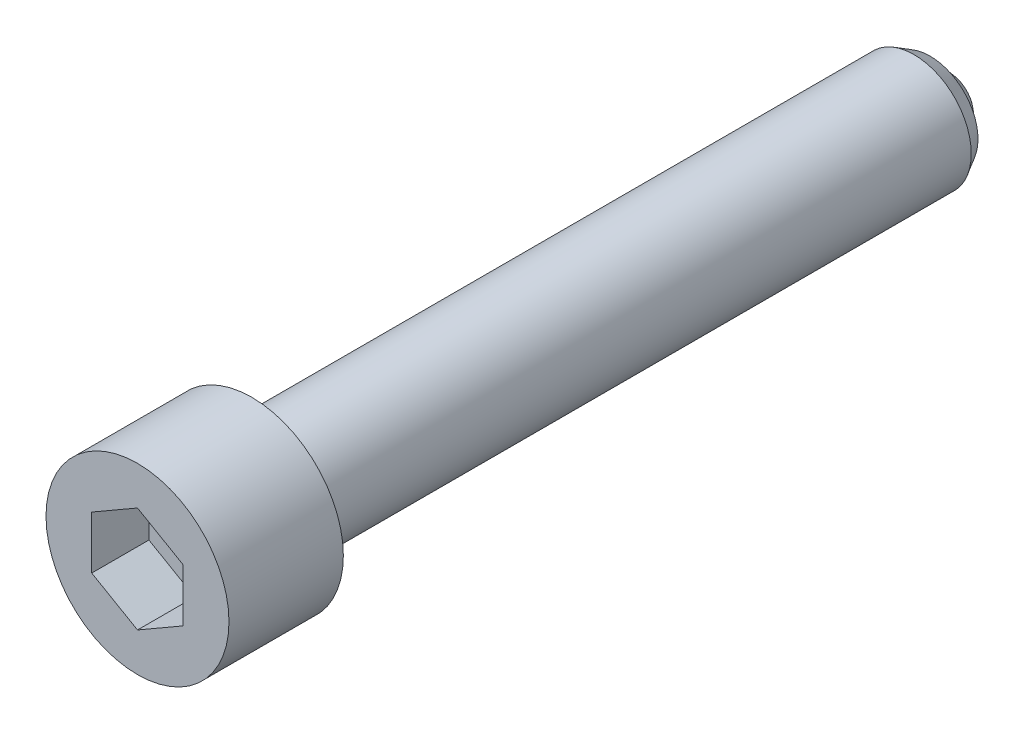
ISO-10303-21;
HEADER;
FILE_DESCRIPTION(('STEP AP214'),'2;1');
FILE_NAME('part.step','',(''),(''),'','','');
FILE_SCHEMA(('AUTOMOTIVE_DESIGN { 1 0 10303 214 1 1 1 1 }'));
ENDSEC;
DATA;
#1=APPLICATION_CONTEXT('core data for automotive mechanical design processes');
#2=APPLICATION_PROTOCOL_DEFINITION('international standard','automotive_design',2000,#1);
#3=PRODUCT_CONTEXT('',#1,'mechanical');
#4=PRODUCT('Part','Part','',(#3));
#5=PRODUCT_RELATED_PRODUCT_CATEGORY('part','',(#4));
#6=PRODUCT_DEFINITION_FORMATION('','',#4);
#7=PRODUCT_DEFINITION_CONTEXT('part definition',#1,'design');
#8=PRODUCT_DEFINITION('design','',#6,#7);
#9=PRODUCT_DEFINITION_SHAPE('','',#8);
#10=(LENGTH_UNIT() NAMED_UNIT(*) SI_UNIT(.MILLI.,.METRE.));
#11=(NAMED_UNIT(*) PLANE_ANGLE_UNIT() SI_UNIT($,.RADIAN.));
#12=(NAMED_UNIT(*) SI_UNIT($,.STERADIAN.) SOLID_ANGLE_UNIT());
#13=UNCERTAINTY_MEASURE_WITH_UNIT(LENGTH_MEASURE(1.E-05),#10,'distance_accuracy_value','');
#14=(GEOMETRIC_REPRESENTATION_CONTEXT(3) GLOBAL_UNCERTAINTY_ASSIGNED_CONTEXT((#13)) GLOBAL_UNIT_ASSIGNED_CONTEXT((#10,
#11,#12)) REPRESENTATION_CONTEXT('',''));
#15=CARTESIAN_POINT('',(0.,0.,0.));
#16=DIRECTION('',(0.,0.,1.));
#17=DIRECTION('',(1.,0.,0.));
#18=AXIS2_PLACEMENT_3D('',#15,#16,#17);
#19=CARTESIAN_POINT('',(0.,0.,3.5));
#20=DIRECTION('',(0.,0.,-1.));
#21=DIRECTION('',(1.,0.,0.));
#22=AXIS2_PLACEMENT_3D('',#19,#20,#21);
#23=SPHERICAL_SURFACE('',#22,3.5);
#24=CARTESIAN_POINT('',(0.,0.,2.4));
#25=DIRECTION('',(0.,0.,-1.));
#26=DIRECTION('',(1.,0.,0.));
#27=AXIS2_PLACEMENT_3D('',#24,#25,#26);
#28=CIRCLE('',#27,3.32264954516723);
#29=CARTESIAN_POINT('',(3.32264954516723,0.,2.4));
#30=VERTEX_POINT('',#29);
#31=EDGE_CURVE('E9',#30,#30,#28,.T.);
#32=ORIENTED_EDGE('',*,*,#31,.T.);
#33=EDGE_LOOP('',(#32));
#34=FACE_BOUND('',#33,.T.);
#35=ADVANCED_FACE('F15',(#34),#23,.T.);
#36=CARTESIAN_POINT('',(4.19170962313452,0.,2.4));
#37=DIRECTION('',(0.,0.,1.));
#38=DIRECTION('',(-1.,0.,0.));
#39=AXIS2_PLACEMENT_3D('',#36,#37,#38);
#40=PLANE('',#39);
#41=ORIENTED_EDGE('',*,*,#31,.F.);
#42=EDGE_LOOP('',(#41));
#43=FACE_BOUND('',#42,.T.);
#44=CARTESIAN_POINT('',(0.,0.,2.4));
#45=DIRECTION('',(0.,0.,-1.));
#46=DIRECTION('',(1.,0.,0.));
#47=AXIS2_PLACEMENT_3D('',#44,#45,#46);
#48=CIRCLE('',#47,4.19170962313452);
#49=CARTESIAN_POINT('',(4.19170962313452,0.,2.4));
#50=VERTEX_POINT('',#49);
#51=EDGE_CURVE('E22',#50,#50,#48,.T.);
#52=ORIENTED_EDGE('',*,*,#51,.T.);
#53=EDGE_LOOP('',(#52));
#54=FACE_BOUND('',#53,.T.);
#55=ADVANCED_FACE('F136',(#43,#54),#40,.F.);
#56=CARTESIAN_POINT('',(0.,0.,3.8));
#57=DIRECTION('',(0.,0.,1.));
#58=DIRECTION('',(-1.,0.,0.));
#59=AXIS2_PLACEMENT_3D('',#56,#57,#58);
#60=CONICAL_SURFACE('',#59,5.,0.5235987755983);
#61=ORIENTED_EDGE('',*,*,#51,.F.);
#62=EDGE_LOOP('',(#61));
#63=FACE_BOUND('',#62,.T.);
#64=CARTESIAN_POINT('',(0.,0.,3.8));
#65=DIRECTION('',(0.,0.,-1.));
#66=DIRECTION('',(1.,0.,0.));
#67=AXIS2_PLACEMENT_3D('',#64,#65,#66);
#68=CIRCLE('',#67,5.);
#69=CARTESIAN_POINT('',(5.,0.,3.8));
#70=VERTEX_POINT('',#69);
#71=EDGE_CURVE('E131',#70,#70,#68,.T.);
#72=ORIENTED_EDGE('',*,*,#71,.T.);
#73=EDGE_LOOP('',(#72));
#74=FACE_BOUND('',#73,.T.);
#75=ADVANCED_FACE('F138',(#63,#74),#60,.T.);
#76=CARTESIAN_POINT('',(0.,0.,11.7));
#77=DIRECTION('',(0.,0.,-1.));
#78=DIRECTION('',(1.,0.,0.));
#79=AXIS2_PLACEMENT_3D('',#76,#77,#78);
#80=CYLINDRICAL_SURFACE('',#79,5.);
#81=CARTESIAN_POINT('',(0.,0.,61.7));
#82=DIRECTION('',(0.,0.,-1.));
#83=DIRECTION('',(1.,0.,0.));
#84=AXIS2_PLACEMENT_3D('',#81,#82,#83);
#85=CIRCLE('',#84,5.);
#86=CARTESIAN_POINT('',(5.,0.,61.7));
#87=VERTEX_POINT('',#86);
#88=EDGE_CURVE('E128',#87,#87,#85,.T.);
#89=ORIENTED_EDGE('',*,*,#88,.T.);
#90=EDGE_LOOP('',(#89));
#91=FACE_BOUND('',#90,.T.);
#92=ORIENTED_EDGE('',*,*,#71,.F.);
#93=EDGE_LOOP('',(#92));
#94=FACE_BOUND('',#93,.T.);
#95=ADVANCED_FACE('F141',(#91,#94),#80,.T.);
#96=CARTESIAN_POINT('',(5.,0.,61.7));
#97=DIRECTION('',(0.,0.,-1.));
#98=DIRECTION('',(1.,0.,0.));
#99=AXIS2_PLACEMENT_3D('',#96,#97,#98);
#100=PLANE('',#99);
#101=CARTESIAN_POINT('',(0.,0.,61.7));
#102=DIRECTION('',(0.,0.,-1.));
#103=DIRECTION('',(1.,0.,0.));
#104=AXIS2_PLACEMENT_3D('',#101,#102,#103);
#105=CIRCLE('',#104,8.);
#106=CARTESIAN_POINT('',(8.,0.,61.7));
#107=VERTEX_POINT('',#106);
#108=EDGE_CURVE('E125',#107,#107,#105,.T.);
#109=ORIENTED_EDGE('',*,*,#108,.T.);
#110=EDGE_LOOP('',(#109));
#111=FACE_BOUND('',#110,.T.);
#112=ORIENTED_EDGE('',*,*,#88,.F.);
#113=EDGE_LOOP('',(#112));
#114=FACE_BOUND('',#113,.T.);
#115=ADVANCED_FACE('F146',(#111,#114),#100,.T.);
#116=CARTESIAN_POINT('',(0.,0.,11.7));
#117=DIRECTION('',(0.,0.,-1.));
#118=DIRECTION('',(1.,0.,0.));
#119=AXIS2_PLACEMENT_3D('',#116,#117,#118);
#120=CYLINDRICAL_SURFACE('',#119,8.);
#121=CARTESIAN_POINT('',(0.,0.,71.7));
#122=DIRECTION('',(0.,0.,-1.));
#123=DIRECTION('',(1.,0.,0.));
#124=AXIS2_PLACEMENT_3D('',#121,#122,#123);
#125=CIRCLE('',#124,8.);
#126=CARTESIAN_POINT('',(8.,0.,71.7));
#127=VERTEX_POINT('',#126);
#128=EDGE_CURVE('E122',#127,#127,#125,.T.);
#129=ORIENTED_EDGE('',*,*,#128,.T.);
#130=EDGE_LOOP('',(#129));
#131=FACE_BOUND('',#130,.T.);
#132=ORIENTED_EDGE('',*,*,#108,.F.);
#133=EDGE_LOOP('',(#132));
#134=FACE_BOUND('',#133,.T.);
#135=ADVANCED_FACE('F153',(#131,#134),#120,.T.);
#136=CARTESIAN_POINT('',(8.,0.,71.7));
#137=DIRECTION('',(0.,0.,1.));
#138=DIRECTION('',(-1.,0.,0.));
#139=AXIS2_PLACEMENT_3D('',#136,#137,#138);
#140=PLANE('',#139);
#141=DIRECTION('',(-0.86602540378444,0.5,0.));
#142=VECTOR('',#141,1.);
#143=CARTESIAN_POINT('',(4.,2.30940107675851,71.7));
#144=LINE('',#143,#142);
#145=CARTESIAN_POINT('',(4.,2.30940107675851,71.7));
#146=VERTEX_POINT('',#145);
#147=CARTESIAN_POINT('',(0.,4.618802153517,71.7));
#148=VERTEX_POINT('',#147);
#149=EDGE_CURVE('E29',#146,#148,#144,.T.);
#150=ORIENTED_EDGE('',*,*,#149,.F.);
#151=DIRECTION('',(0.,1.,0.));
#152=VECTOR('',#151,1.);
#153=CARTESIAN_POINT('',(4.,-2.30940107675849,71.7));
#154=LINE('',#153,#152);
#155=CARTESIAN_POINT('',(4.,-2.30940107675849,71.7));
#156=VERTEX_POINT('',#155);
#157=EDGE_CURVE('E98',#156,#146,#154,.T.);
#158=ORIENTED_EDGE('',*,*,#157,.F.);
#159=DIRECTION('',(-0.866025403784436,-0.5,0.));
#160=VECTOR('',#159,1.);
#161=CARTESIAN_POINT('',(4.,-2.30940107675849,71.7));
#162=LINE('',#161,#160);
#163=CARTESIAN_POINT('',(0.,-4.61880215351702,71.7));
#164=VERTEX_POINT('',#163);
#165=EDGE_CURVE('E93',#156,#164,#162,.T.);
#166=ORIENTED_EDGE('',*,*,#165,.T.);
#167=DIRECTION('',(0.866025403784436,-0.5,0.));
#168=VECTOR('',#167,1.);
#169=CARTESIAN_POINT('',(-4.,-2.30940107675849,71.7));
#170=LINE('',#169,#168);
#171=CARTESIAN_POINT('',(-4.,-2.30940107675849,71.7));
#172=VERTEX_POINT('',#171);
#173=EDGE_CURVE('E91',#172,#164,#170,.T.);
#174=ORIENTED_EDGE('',*,*,#173,.F.);
#175=DIRECTION('',(0.,1.,0.));
#176=VECTOR('',#175,1.);
#177=CARTESIAN_POINT('',(-4.,-2.30940107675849,71.7));
#178=LINE('',#177,#176);
#179=CARTESIAN_POINT('',(-4.,2.30940107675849,71.7));
#180=VERTEX_POINT('',#179);
#181=EDGE_CURVE('E72',#172,#180,#178,.T.);
#182=ORIENTED_EDGE('',*,*,#181,.T.);
#183=DIRECTION('',(0.866025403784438,0.5,0.));
#184=VECTOR('',#183,1.);
#185=CARTESIAN_POINT('',(-4.,2.30940107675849,71.7));
#186=LINE('',#185,#184);
#187=EDGE_CURVE('E83',#180,#148,#186,.T.);
#188=ORIENTED_EDGE('',*,*,#187,.T.);
#189=EDGE_LOOP('',(#150,#158,#166,#174,#182,#188));
#190=FACE_BOUND('',#189,.T.);
#191=ORIENTED_EDGE('',*,*,#128,.F.);
#192=EDGE_LOOP('',(#191));
#193=FACE_BOUND('',#192,.T.);
#194=ADVANCED_FACE('F87',(#190,#193),#140,.T.);
#195=CARTESIAN_POINT('',(4.,2.30940107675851,66.7));
#196=DIRECTION('',(0.5,0.86602540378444,0.));
#197=DIRECTION('',(0.86602540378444,-0.5,0.));
#198=AXIS2_PLACEMENT_3D('',#195,#196,#197);
#199=PLANE('',#198);
#200=DIRECTION('',(0.,0.,1.));
#201=VECTOR('',#200,1.);
#202=CARTESIAN_POINT('',(4.,2.30940107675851,66.7));
#203=LINE('',#202,#201);
#204=CARTESIAN_POINT('',(4.,2.30940107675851,66.7));
#205=VERTEX_POINT('',#204);
#206=EDGE_CURVE('E36',#205,#146,#203,.T.);
#207=ORIENTED_EDGE('',*,*,#206,.T.);
#208=ORIENTED_EDGE('',*,*,#149,.T.);
#209=DIRECTION('',(0.,0.,1.));
#210=VECTOR('',#209,1.);
#211=CARTESIAN_POINT('',(0.,4.618802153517,66.7));
#212=LINE('',#211,#210);
#213=CARTESIAN_POINT('',(0.,4.618802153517,66.7));
#214=VERTEX_POINT('',#213);
#215=EDGE_CURVE('E80',#214,#148,#212,.T.);
#216=ORIENTED_EDGE('',*,*,#215,.F.);
#217=DIRECTION('',(-0.86602540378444,0.5,0.));
#218=VECTOR('',#217,1.);
#219=CARTESIAN_POINT('',(4.,2.30940107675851,66.7));
#220=LINE('',#219,#218);
#221=EDGE_CURVE('E100',#205,#214,#220,.T.);
#222=ORIENTED_EDGE('',*,*,#221,.F.);
#223=EDGE_LOOP('',(#207,#208,#216,#222));
#224=FACE_BOUND('',#223,.T.);
#225=ADVANCED_FACE('F205',(#224),#199,.F.);
#226=CARTESIAN_POINT('',(4.,-2.30940107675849,66.7));
#227=DIRECTION('',(1.,0.,0.));
#228=DIRECTION('',(0.,-1.,0.));
#229=AXIS2_PLACEMENT_3D('',#226,#227,#228);
#230=PLANE('',#229);
#231=DIRECTION('',(0.,0.,1.));
#232=VECTOR('',#231,1.);
#233=CARTESIAN_POINT('',(4.,-2.30940107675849,66.7));
#234=LINE('',#233,#232);
#235=CARTESIAN_POINT('',(4.,-2.30940107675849,66.7));
#236=VERTEX_POINT('',#235);
#237=EDGE_CURVE('E119',#236,#156,#234,.T.);
#238=ORIENTED_EDGE('',*,*,#237,.T.);
#239=ORIENTED_EDGE('',*,*,#157,.T.);
#240=ORIENTED_EDGE('',*,*,#206,.F.);
#241=DIRECTION('',(0.,1.,0.));
#242=VECTOR('',#241,1.);
#243=CARTESIAN_POINT('',(4.,-2.30940107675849,66.7));
#244=LINE('',#243,#242);
#245=EDGE_CURVE('E112',#236,#205,#244,.T.);
#246=ORIENTED_EDGE('',*,*,#245,.F.);
#247=EDGE_LOOP('',(#238,#239,#240,#246));
#248=FACE_BOUND('',#247,.T.);
#249=ADVANCED_FACE('F214',(#248),#230,.F.);
#250=CARTESIAN_POINT('',(4.,-2.30940107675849,66.7));
#251=DIRECTION('',(-0.5,0.866025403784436,0.));
#252=DIRECTION('',(0.866025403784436,0.5,0.));
#253=AXIS2_PLACEMENT_3D('',#250,#251,#252);
#254=PLANE('',#253);
#255=DIRECTION('',(0.,0.,1.));
#256=VECTOR('',#255,1.);
#257=CARTESIAN_POINT('',(0.,-4.61880215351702,66.7));
#258=LINE('',#257,#256);
#259=CARTESIAN_POINT('',(0.,-4.61880215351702,66.7));
#260=VERTEX_POINT('',#259);
#261=EDGE_CURVE('E117',#260,#164,#258,.T.);
#262=ORIENTED_EDGE('',*,*,#261,.T.);
#263=ORIENTED_EDGE('',*,*,#165,.F.);
#264=ORIENTED_EDGE('',*,*,#237,.F.);
#265=DIRECTION('',(-0.866025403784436,-0.5,0.));
#266=VECTOR('',#265,1.);
#267=CARTESIAN_POINT('',(4.,-2.30940107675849,66.7));
#268=LINE('',#267,#266);
#269=EDGE_CURVE('E109',#236,#260,#268,.T.);
#270=ORIENTED_EDGE('',*,*,#269,.T.);
#271=EDGE_LOOP('',(#262,#263,#264,#270));
#272=FACE_BOUND('',#271,.T.);
#273=ADVANCED_FACE('F223',(#272),#254,.T.);
#274=CARTESIAN_POINT('',(-4.,-2.30940107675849,66.7));
#275=DIRECTION('',(-0.5,-0.866025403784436,0.));
#276=DIRECTION('',(-0.866025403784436,0.5,0.));
#277=AXIS2_PLACEMENT_3D('',#274,#275,#276);
#278=PLANE('',#277);
#279=DIRECTION('',(0.,0.,1.));
#280=VECTOR('',#279,1.);
#281=CARTESIAN_POINT('',(-4.,-2.30940107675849,66.7));
#282=LINE('',#281,#280);
#283=CARTESIAN_POINT('',(-4.,-2.30940107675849,66.7));
#284=VERTEX_POINT('',#283);
#285=EDGE_CURVE('E79',#284,#172,#282,.T.);
#286=ORIENTED_EDGE('',*,*,#285,.T.);
#287=ORIENTED_EDGE('',*,*,#173,.T.);
#288=ORIENTED_EDGE('',*,*,#261,.F.);
#289=DIRECTION('',(0.866025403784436,-0.5,0.));
#290=VECTOR('',#289,1.);
#291=CARTESIAN_POINT('',(-4.,-2.30940107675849,66.7));
#292=LINE('',#291,#290);
#293=EDGE_CURVE('E106',#284,#260,#292,.T.);
#294=ORIENTED_EDGE('',*,*,#293,.F.);
#295=EDGE_LOOP('',(#286,#287,#288,#294));
#296=FACE_BOUND('',#295,.T.);
#297=ADVANCED_FACE('F232',(#296),#278,.F.);
#298=CARTESIAN_POINT('',(-4.,-2.30940107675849,66.7));
#299=DIRECTION('',(1.,0.,0.));
#300=DIRECTION('',(0.,-1.,0.));
#301=AXIS2_PLACEMENT_3D('',#298,#299,#300);
#302=PLANE('',#301);
#303=DIRECTION('',(0.,0.,1.));
#304=VECTOR('',#303,1.);
#305=CARTESIAN_POINT('',(-4.,2.30940107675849,66.7));
#306=LINE('',#305,#304);
#307=CARTESIAN_POINT('',(-4.,2.30940107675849,66.7));
#308=VERTEX_POINT('',#307);
#309=EDGE_CURVE('E68',#308,#180,#306,.T.);
#310=ORIENTED_EDGE('',*,*,#309,.T.);
#311=ORIENTED_EDGE('',*,*,#181,.F.);
#312=ORIENTED_EDGE('',*,*,#285,.F.);
#313=DIRECTION('',(0.,1.,0.));
#314=VECTOR('',#313,1.);
#315=CARTESIAN_POINT('',(-4.,-2.30940107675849,66.7));
#316=LINE('',#315,#314);
#317=EDGE_CURVE('E75',#284,#308,#316,.T.);
#318=ORIENTED_EDGE('',*,*,#317,.T.);
#319=EDGE_LOOP('',(#310,#311,#312,#318));
#320=FACE_BOUND('',#319,.T.);
#321=ADVANCED_FACE('F70',(#320),#302,.T.);
#322=CARTESIAN_POINT('',(-4.,2.30940107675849,66.7));
#323=DIRECTION('',(0.5,-0.866025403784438,0.));
#324=DIRECTION('',(-0.866025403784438,-0.5,0.));
#325=AXIS2_PLACEMENT_3D('',#322,#323,#324);
#326=PLANE('',#325);
#327=DIRECTION('',(0.866025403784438,0.5,0.));
#328=VECTOR('',#327,1.);
#329=CARTESIAN_POINT('',(-4.,2.30940107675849,66.7));
#330=LINE('',#329,#328);
#331=EDGE_CURVE('E103',#308,#214,#330,.T.);
#332=ORIENTED_EDGE('',*,*,#331,.T.);
#333=ORIENTED_EDGE('',*,*,#215,.T.);
#334=ORIENTED_EDGE('',*,*,#187,.F.);
#335=ORIENTED_EDGE('',*,*,#309,.F.);
#336=EDGE_LOOP('',(#332,#333,#334,#335));
#337=FACE_BOUND('',#336,.T.);
#338=ADVANCED_FACE('F84',(#337),#326,.T.);
#339=CARTESIAN_POINT('',(8.,0.,66.7));
#340=DIRECTION('',(0.,0.,1.));
#341=DIRECTION('',(-1.,0.,0.));
#342=AXIS2_PLACEMENT_3D('',#339,#340,#341);
#343=PLANE('',#342);
#344=ORIENTED_EDGE('',*,*,#221,.T.);
#345=ORIENTED_EDGE('',*,*,#331,.F.);
#346=ORIENTED_EDGE('',*,*,#317,.F.);
#347=ORIENTED_EDGE('',*,*,#293,.T.);
#348=ORIENTED_EDGE('',*,*,#269,.F.);
#349=ORIENTED_EDGE('',*,*,#245,.T.);
#350=EDGE_LOOP('',(#344,#345,#346,#347,#348,#349));
#351=FACE_BOUND('',#350,.T.);
#352=ADVANCED_FACE('F252',(#351),#343,.T.);
#353=CLOSED_SHELL('',(#35,#55,#75,#95,#115,#135,#194,#225,#249,#273,#297,#321,#338,#352));
#354=MANIFOLD_SOLID_BREP('B1',#353);
#355=ADVANCED_BREP_SHAPE_REPRESENTATION('',(#18,#354),#14);
#356=SHAPE_DEFINITION_REPRESENTATION(#9,#355);
ENDSEC;
END-ISO-10303-21;
